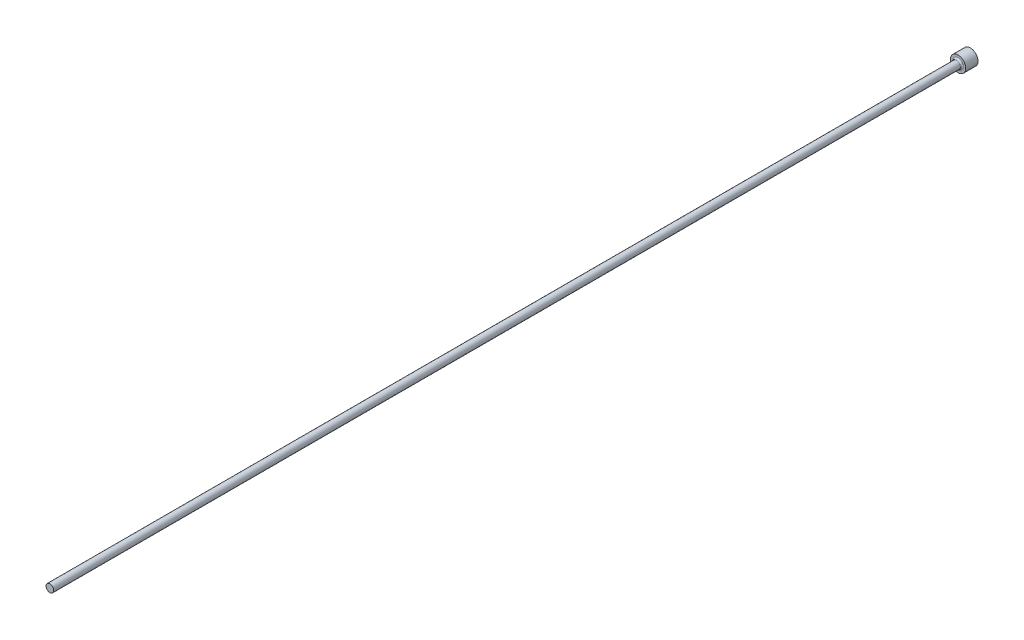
ISO-10303-21;
HEADER;
FILE_DESCRIPTION(('STEP AP214'),'2;1');
FILE_NAME('part.step','',(''),(''),'','','');
FILE_SCHEMA(('AUTOMOTIVE_DESIGN { 1 0 10303 214 1 1 1 1 }'));
ENDSEC;
DATA;
#1=APPLICATION_CONTEXT('core data for automotive mechanical design processes');
#2=APPLICATION_PROTOCOL_DEFINITION('international standard','automotive_design',2000,#1);
#3=PRODUCT_CONTEXT('',#1,'mechanical');
#4=PRODUCT('Part','Part','',(#3));
#5=PRODUCT_RELATED_PRODUCT_CATEGORY('part','',(#4));
#6=PRODUCT_DEFINITION_FORMATION('','',#4);
#7=PRODUCT_DEFINITION_CONTEXT('part definition',#1,'design');
#8=PRODUCT_DEFINITION('design','',#6,#7);
#9=PRODUCT_DEFINITION_SHAPE('','',#8);
#10=(LENGTH_UNIT() NAMED_UNIT(*) SI_UNIT(.MILLI.,.METRE.));
#11=(NAMED_UNIT(*) PLANE_ANGLE_UNIT() SI_UNIT($,.RADIAN.));
#12=(NAMED_UNIT(*) SI_UNIT($,.STERADIAN.) SOLID_ANGLE_UNIT());
#13=UNCERTAINTY_MEASURE_WITH_UNIT(LENGTH_MEASURE(1.E-05),#10,'distance_accuracy_value','');
#14=(GEOMETRIC_REPRESENTATION_CONTEXT(3) GLOBAL_UNCERTAINTY_ASSIGNED_CONTEXT((#13)) GLOBAL_UNIT_ASSIGNED_CONTEXT((#10,
#11,#12)) REPRESENTATION_CONTEXT('',''));
#15=CARTESIAN_POINT('',(0.,0.,0.));
#16=DIRECTION('',(0.,0.,1.));
#17=DIRECTION('',(1.,0.,0.));
#18=AXIS2_PLACEMENT_3D('',#15,#16,#17);
#19=CARTESIAN_POINT('',(2.5,0.,4.));
#20=DIRECTION('',(0.,0.,-1.));
#21=DIRECTION('',(-1.,0.,0.));
#22=AXIS2_PLACEMENT_3D('',#19,#20,#21);
#23=PLANE('',#22);
#24=CARTESIAN_POINT('',(0.,0.,4.));
#25=DIRECTION('',(0.,0.,-1.));
#26=DIRECTION('',(-1.,0.,0.));
#27=AXIS2_PLACEMENT_3D('',#24,#25,#26);
#28=CIRCLE('',#27,1.75000000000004);
#29=CARTESIAN_POINT('',(-1.75000000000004,0.,4.));
#30=VERTEX_POINT('',#29);
#31=EDGE_CURVE('E40',#30,#30,#28,.T.);
#32=ORIENTED_EDGE('',*,*,#31,.T.);
#33=EDGE_LOOP('',(#32));
#34=FACE_BOUND('',#33,.T.);
#35=CARTESIAN_POINT('',(0.,0.,4.));
#36=DIRECTION('',(0.,0.,-1.));
#37=DIRECTION('',(-1.,0.,0.));
#38=AXIS2_PLACEMENT_3D('',#35,#36,#37);
#39=CIRCLE('',#38,2.5);
#40=CARTESIAN_POINT('',(-2.5,0.,4.));
#41=VERTEX_POINT('',#40);
#42=EDGE_CURVE('E44',#41,#41,#39,.T.);
#43=ORIENTED_EDGE('',*,*,#42,.F.);
#44=EDGE_LOOP('',(#43));
#45=FACE_BOUND('',#44,.T.);
#46=ADVANCED_FACE('F33',(#34,#45),#23,.F.);
#47=CARTESIAN_POINT('',(0.,0.,-9.03322817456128));
#48=DIRECTION('',(0.,0.,-1.));
#49=DIRECTION('',(-1.,0.,0.));
#50=AXIS2_PLACEMENT_3D('',#47,#48,#49);
#51=CYLINDRICAL_SURFACE('',#50,2.5);
#52=CARTESIAN_POINT('',(0.,0.,0.));
#53=DIRECTION('',(0.,0.,-1.));
#54=DIRECTION('',(-1.,0.,0.));
#55=AXIS2_PLACEMENT_3D('',#52,#53,#54);
#56=CIRCLE('',#55,2.5);
#57=CARTESIAN_POINT('',(-2.5,0.,0.));
#58=VERTEX_POINT('',#57);
#59=EDGE_CURVE('E48',#58,#58,#56,.T.);
#60=ORIENTED_EDGE('',*,*,#59,.F.);
#61=EDGE_LOOP('',(#60));
#62=FACE_BOUND('',#61,.T.);
#63=ORIENTED_EDGE('',*,*,#42,.T.);
#64=EDGE_LOOP('',(#63));
#65=FACE_BOUND('',#64,.T.);
#66=ADVANCED_FACE('F68',(#62,#65),#51,.T.);
#67=CARTESIAN_POINT('',(0.,0.,0.));
#68=DIRECTION('',(0.,0.,1.));
#69=DIRECTION('',(1.,0.,0.));
#70=AXIS2_PLACEMENT_3D('',#67,#68,#69);
#71=PLANE('',#70);
#72=ORIENTED_EDGE('',*,*,#59,.T.);
#73=EDGE_LOOP('',(#72));
#74=FACE_BOUND('',#73,.T.);
#75=ADVANCED_FACE('F61',(#74),#71,.F.);
#76=CARTESIAN_POINT('',(0.,0.,300.));
#77=DIRECTION('',(0.,0.,-1.));
#78=DIRECTION('',(-1.,0.,0.));
#79=AXIS2_PLACEMENT_3D('',#76,#77,#78);
#80=PLANE('',#79);
#81=CARTESIAN_POINT('',(0.,0.,300.));
#82=DIRECTION('',(0.,0.,-1.));
#83=DIRECTION('',(-1.,0.,0.));
#84=AXIS2_PLACEMENT_3D('',#81,#82,#83);
#85=CIRCLE('',#84,1.25000000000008);
#86=CARTESIAN_POINT('',(-1.25000000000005,0.,300.));
#87=VERTEX_POINT('',#86);
#88=EDGE_CURVE('E53',#87,#87,#85,.T.);
#89=ORIENTED_EDGE('',*,*,#88,.F.);
#90=EDGE_LOOP('',(#89));
#91=FACE_BOUND('',#90,.T.);
#92=ADVANCED_FACE('F59',(#91),#80,.F.);
#93=CARTESIAN_POINT('',(0.,0.,-9.03322817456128));
#94=DIRECTION('',(0.,0.,-1.));
#95=DIRECTION('',(-1.,0.,0.));
#96=AXIS2_PLACEMENT_3D('',#93,#94,#95);
#97=CYLINDRICAL_SURFACE('',#96,1.25000000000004);
#98=CARTESIAN_POINT('',(0.,0.,4.5));
#99=DIRECTION('',(0.,0.,-1.));
#100=DIRECTION('',(-1.,0.,0.));
#101=AXIS2_PLACEMENT_3D('',#98,#99,#100);
#102=CIRCLE('',#101,1.25000000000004);
#103=CARTESIAN_POINT('',(-1.25000000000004,0.,4.5));
#104=VERTEX_POINT('',#103);
#105=EDGE_CURVE('E10',#104,#104,#102,.F.);
#106=ORIENTED_EDGE('',*,*,#105,.T.);
#107=EDGE_LOOP('',(#106));
#108=FACE_BOUND('',#107,.T.);
#109=ORIENTED_EDGE('',*,*,#88,.T.);
#110=EDGE_LOOP('',(#109));
#111=FACE_BOUND('',#110,.T.);
#112=ADVANCED_FACE('F57',(#108,#111),#97,.T.);
#113=CARTESIAN_POINT('',(0.,0.,4.5));
#114=DIRECTION('',(0.,0.,-1.));
#115=DIRECTION('',(-1.,0.,0.));
#116=AXIS2_PLACEMENT_3D('',#113,#114,#115);
#117=TOROIDAL_SURFACE('',#116,1.75000000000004,0.5);
#118=ORIENTED_EDGE('',*,*,#105,.F.);
#119=EDGE_LOOP('',(#118));
#120=FACE_BOUND('',#119,.T.);
#121=ORIENTED_EDGE('',*,*,#31,.F.);
#122=EDGE_LOOP('',(#121));
#123=FACE_BOUND('',#122,.T.);
#124=ADVANCED_FACE('F35',(#120,#123),#117,.F.);
#125=CLOSED_SHELL('',(#46,#66,#75,#92,#112,#124));
#126=MANIFOLD_SOLID_BREP('B2',#125);
#127=ADVANCED_BREP_SHAPE_REPRESENTATION('',(#18,#126),#14);
#128=SHAPE_DEFINITION_REPRESENTATION(#9,#127);
ENDSEC;
END-ISO-10303-21;
